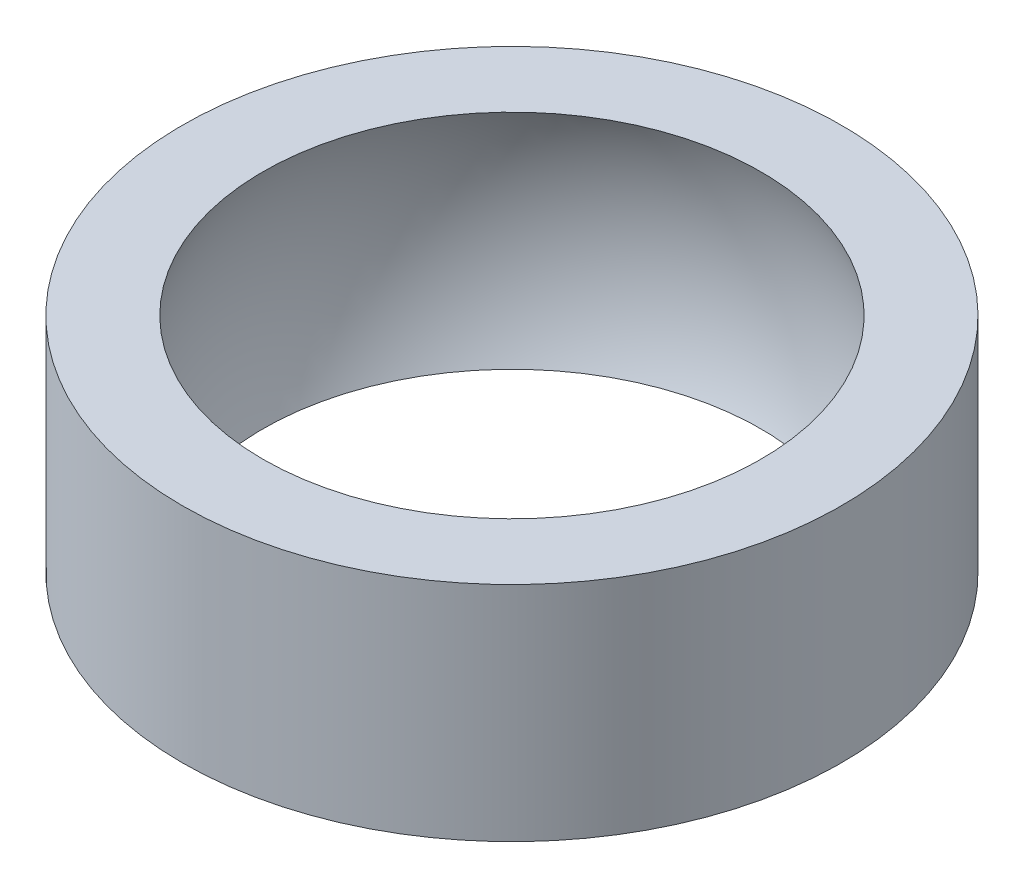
ISO-10303-21;
HEADER;
FILE_DESCRIPTION(('STEP AP214'),'2;1');
FILE_NAME('part.step','',(''),(''),'','','');
FILE_SCHEMA(('AUTOMOTIVE_DESIGN { 1 0 10303 214 1 1 1 1 }'));
ENDSEC;
DATA;
#1=APPLICATION_CONTEXT('core data for automotive mechanical design processes');
#2=APPLICATION_PROTOCOL_DEFINITION('international standard','automotive_design',2000,#1);
#3=PRODUCT_CONTEXT('',#1,'mechanical');
#4=PRODUCT('Part','Part','',(#3));
#5=PRODUCT_RELATED_PRODUCT_CATEGORY('part','',(#4));
#6=PRODUCT_DEFINITION_FORMATION('','',#4);
#7=PRODUCT_DEFINITION_CONTEXT('part definition',#1,'design');
#8=PRODUCT_DEFINITION('design','',#6,#7);
#9=PRODUCT_DEFINITION_SHAPE('','',#8);
#10=(LENGTH_UNIT() NAMED_UNIT(*) SI_UNIT(.MILLI.,.METRE.));
#11=(NAMED_UNIT(*) PLANE_ANGLE_UNIT() SI_UNIT($,.RADIAN.));
#12=(NAMED_UNIT(*) SI_UNIT($,.STERADIAN.) SOLID_ANGLE_UNIT());
#13=UNCERTAINTY_MEASURE_WITH_UNIT(LENGTH_MEASURE(1.E-05),#10,'distance_accuracy_value','');
#14=(GEOMETRIC_REPRESENTATION_CONTEXT(3) GLOBAL_UNCERTAINTY_ASSIGNED_CONTEXT((#13)) GLOBAL_UNIT_ASSIGNED_CONTEXT((#10,
#11,#12)) REPRESENTATION_CONTEXT('',''));
#15=CARTESIAN_POINT('',(0.,0.,0.));
#16=DIRECTION('',(0.,0.,1.));
#17=DIRECTION('',(1.,0.,0.));
#18=AXIS2_PLACEMENT_3D('',#15,#16,#17);
#19=CARTESIAN_POINT('',(0.,0.,0.));
#20=DIRECTION('',(0.,0.,1.));
#21=DIRECTION('',(1.,0.,0.));
#22=AXIS2_PLACEMENT_3D('',#19,#20,#21);
#23=SPHERICAL_SURFACE('',#22,24.5);
#24=CARTESIAN_POINT('',(0.,0.,0.));
#25=DIRECTION('',(0.,1.,0.));
#26=DIRECTION('',(0.,0.,1.));
#27=AXIS2_PLACEMENT_3D('',#24,#25,#26);
#28=SPHERICAL_SURFACE('',#27,24.5);
#29=CARTESIAN_POINT('',(0.,-10.,0.));
#30=DIRECTION('',(0.,1.,0.));
#31=DIRECTION('',(0.,0.,1.));
#32=AXIS2_PLACEMENT_3D('',#29,#30,#31);
#33=CIRCLE('',#32,22.366269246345);
#34=CARTESIAN_POINT('',(0.,-10.,22.366269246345));
#35=VERTEX_POINT('',#34);
#36=EDGE_CURVE('E45',#35,#35,#33,.T.);
#37=ORIENTED_EDGE('',*,*,#36,.F.);
#38=EDGE_LOOP('',(#37));
#39=FACE_BOUND('',#38,.T.);
#40=CARTESIAN_POINT('',(0.,10.,0.));
#41=DIRECTION('',(0.,1.,0.));
#42=DIRECTION('',(0.,0.,1.));
#43=AXIS2_PLACEMENT_3D('',#40,#41,#42);
#44=CIRCLE('',#43,22.366269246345);
#45=CARTESIAN_POINT('',(0.,10.,22.366269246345));
#46=VERTEX_POINT('',#45);
#47=EDGE_CURVE('E10',#46,#46,#44,.T.);
#48=ORIENTED_EDGE('',*,*,#47,.T.);
#49=EDGE_LOOP('',(#48));
#50=FACE_BOUND('',#49,.T.);
#51=ADVANCED_FACE('F31',(#39,#50),#28,.F.);
#52=CARTESIAN_POINT('',(-29.6,10.,0.));
#53=DIRECTION('',(0.,-1.,0.));
#54=DIRECTION('',(0.,0.,-1.));
#55=AXIS2_PLACEMENT_3D('',#52,#53,#54);
#56=PLANE('',#55);
#57=ORIENTED_EDGE('',*,*,#47,.F.);
#58=EDGE_LOOP('',(#57));
#59=FACE_BOUND('',#58,.T.);
#60=CARTESIAN_POINT('',(0.,10.,0.));
#61=DIRECTION('',(0.,1.,0.));
#62=DIRECTION('',(0.,0.,1.));
#63=AXIS2_PLACEMENT_3D('',#60,#61,#62);
#64=CIRCLE('',#63,29.6);
#65=CARTESIAN_POINT('',(0.,10.,29.6));
#66=VERTEX_POINT('',#65);
#67=EDGE_CURVE('E37',#66,#66,#64,.T.);
#68=ORIENTED_EDGE('',*,*,#67,.T.);
#69=EDGE_LOOP('',(#68));
#70=FACE_BOUND('',#69,.T.);
#71=ADVANCED_FACE('F55',(#59,#70),#56,.F.);
#72=CARTESIAN_POINT('',(0.,16.9250532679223,0.));
#73=DIRECTION('',(0.,1.,0.));
#74=DIRECTION('',(0.,0.,1.));
#75=AXIS2_PLACEMENT_3D('',#72,#73,#74);
#76=CYLINDRICAL_SURFACE('',#75,29.6);
#77=CARTESIAN_POINT('',(0.,-10.,0.));
#78=DIRECTION('',(0.,1.,0.));
#79=DIRECTION('',(0.,0.,1.));
#80=AXIS2_PLACEMENT_3D('',#77,#78,#79);
#81=CIRCLE('',#80,29.6);
#82=CARTESIAN_POINT('',(0.,-10.,29.6));
#83=VERTEX_POINT('',#82);
#84=EDGE_CURVE('E41',#83,#83,#81,.T.);
#85=ORIENTED_EDGE('',*,*,#84,.T.);
#86=EDGE_LOOP('',(#85));
#87=FACE_BOUND('',#86,.T.);
#88=ORIENTED_EDGE('',*,*,#67,.F.);
#89=EDGE_LOOP('',(#88));
#90=FACE_BOUND('',#89,.T.);
#91=ADVANCED_FACE('F59',(#87,#90),#76,.T.);
#92=CARTESIAN_POINT('',(-29.6,-10.,0.));
#93=DIRECTION('',(0.,-1.,0.));
#94=DIRECTION('',(0.,0.,-1.));
#95=AXIS2_PLACEMENT_3D('',#92,#93,#94);
#96=PLANE('',#95);
#97=ORIENTED_EDGE('',*,*,#36,.T.);
#98=EDGE_LOOP('',(#97));
#99=FACE_BOUND('',#98,.T.);
#100=ORIENTED_EDGE('',*,*,#84,.F.);
#101=EDGE_LOOP('',(#100));
#102=FACE_BOUND('',#101,.T.);
#103=ADVANCED_FACE('F51',(#99,#102),#96,.T.);
#104=CLOSED_SHELL('',(#51,#71,#91,#103));
#105=MANIFOLD_SOLID_BREP('B2',#104);
#106=ADVANCED_BREP_SHAPE_REPRESENTATION('',(#18,#105),#14);
#107=SHAPE_DEFINITION_REPRESENTATION(#9,#106);
ENDSEC;
END-ISO-10303-21;
